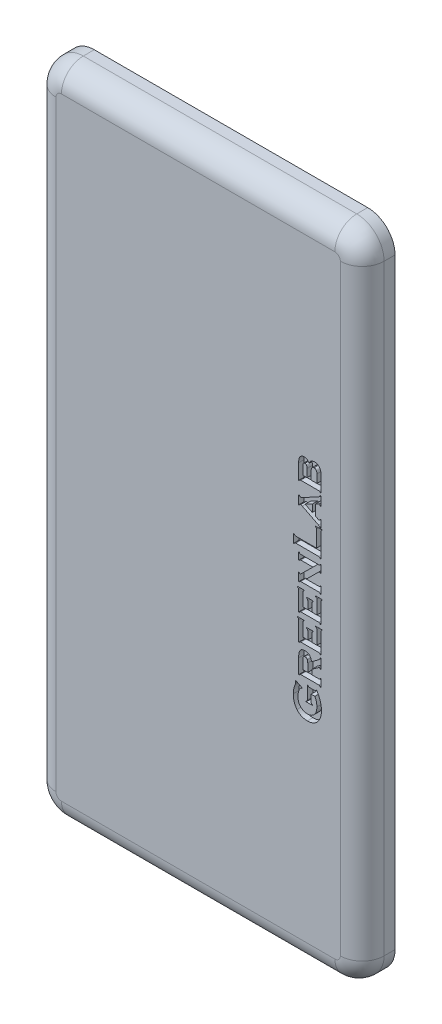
from build123d import *

# Parameters (mm, degrees)
SKETCH1_W           = 29.999998
SKETCH1_H           = 60.000000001
BOSS_EXTRUDE1_DEPTH = 3
FILLET1_R           = 2.5
FILLET2_R           = 2
CUT_EXTRUDE1_DEPTH  = 0.5


with BuildPart() as part:
    # Sketch1 → Boss-Extrude1 (new body)
    with BuildSketch(Plane.XY.offset(3)):
        with Locations((-9.58e-07, 15.00000116)):
            Rectangle(SKETCH1_W, SKETCH1_H)
    extrude(amount=-BOSS_EXTRUDE1_DEPTH)

    # Fillet1
    fillet1_edges = [part.edges().sort_by_distance(p)[0] for p in [
        (-14.999999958, -14.999998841, 1.5),
        (-14.999999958, 45.00000116, 1.5),
        (14.999998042, 45.00000116, 1.5),
        (14.999998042, -14.999998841, 1.5),
    ]]
    fillet(fillet1_edges, radius=FILLET1_R)

    # Fillet2
    fillet2_edges = [part.edges().sort_by_distance(p)[0] for p in [
        (14.999998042, 15.000001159, 3),
        (-9.58e-07, -14.999998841, 3),
        (-9.58e-07, 45.00000116, 3),
        (-14.999999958, 15.000001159, 3),
        (-14.267766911, -14.267765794, 3),
        (-14.267766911, 44.267768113, 3),
        (14.267764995, -14.267765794, 3),
        (14.267764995, 44.267768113, 3),
    ]]
    fillet(fillet2_edges, radius=FILLET2_R)

    # Sketch2 → Cut-Extrude1 (cut)
    # profile 1 of 8: a face of its own
    with BuildSketch(Plane.XY.offset(3)):
        with BuildLine():
            add(Edge.make_bspline(
                [(10.135549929, 25.073785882), (10.146799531, 25.097644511), (10.168002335, 25.14261231), (10.202794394, 25.203529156), (10.237086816, 25.254863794), (10.262562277, 25.283443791), (10.274438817, 25.296767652)],
                knots=[0, 0, 0, 0, 1.199284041, 2.260363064, 3.188989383, 4, 4, 4, 4], degree=3))
            add(Edge.make_bspline(
                [(10.274438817, 25.296767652), (10.285608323, 25.307686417), (10.307958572, 25.329534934), (10.345403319, 25.357738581), (10.386093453, 25.380997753), (10.428917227, 25.400929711), (10.475165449, 25.415333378), (10.523949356, 25.426236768), (10.575727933, 25.432844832), (10.611152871, 25.433628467), (10.629256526, 25.434028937)],
                knots=[0, 0, 0, 0, 0.957204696, 1.915372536, 2.864513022, 3.827290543, 4.805779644, 5.828215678, 6.89012558, 8, 8, 8, 8], degree=3))
            add(Edge.make_bspline(
                [(10.629256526, 25.434028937), (10.653530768, 25.433486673), (10.700864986, 25.432429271), (10.76981119, 25.421764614), (10.834605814, 25.404777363), (10.894850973, 25.379795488), (10.951219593, 25.349148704), (11.002600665, 25.310326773), (11.050400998, 25.265337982), (11.077646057, 25.230423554), (11.091496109, 25.212674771)],
                knots=[0, 0, 0, 0, 1.09149512, 2.128390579, 3.131133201, 4.098244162, 5.056171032, 6.009871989, 6.988316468, 8, 8, 8, 8], degree=3))
            add(Edge.make_bspline(
                [(11.091496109, 25.212674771), (11.103079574, 25.195720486), (11.126628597, 25.161252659), (11.155524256, 25.104416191), (11.180550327, 25.043452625), (11.201282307, 24.977999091), (11.216981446, 24.907741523), (11.227261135, 24.832767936), (11.234867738, 24.753301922), (11.235490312, 24.698733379), (11.235810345, 24.670682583)],
                knots=[0, 0, 0, 0, 0.863603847, 1.755694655, 2.67743618, 3.635676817, 4.642232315, 5.703768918, 6.81962927, 8, 8, 8, 8], degree=3))
            Line((11.235810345, 24.670682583), (11.235810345, 23.246528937))
            Line((11.235810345, 23.246528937), (11.166365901, 23.246528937))
            add(Edge.make_bspline(
                [(11.166365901, 23.246528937), (11.163435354, 23.255433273), (11.157951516, 23.272095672), (11.148016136, 23.2951228), (11.134770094, 23.312951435), (11.120169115, 23.327491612), (11.102620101, 23.337942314), (11.082440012, 23.345531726), (11.058935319, 23.349790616), (11.042323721, 23.350380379), (11.033444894, 23.350695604)],
                knots=[0, 0, 0, 0, 1.214308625, 2.272296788, 3.227641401, 4.072125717, 4.923398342, 5.849609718, 6.850625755, 8, 8, 8, 8], degree=3))
            Line((11.033444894, 23.350695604), (9.389564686, 23.350695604))
            add(Edge.make_bspline(
                [(9.389564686, 23.350695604), (9.380885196, 23.350288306), (9.36452139, 23.34952041), (9.341170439, 23.346368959), (9.321643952, 23.338320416), (9.304262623, 23.328656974), (9.290415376, 23.313814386), (9.277114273, 23.295900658), (9.266068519, 23.272714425), (9.25991858, 23.255627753), (9.256643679, 23.246528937)],
                knots=[0, 0, 0, 0, 1.128659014, 2.127908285, 3.03439063, 3.855433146, 4.685150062, 5.642745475, 6.744739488, 8, 8, 8, 8], degree=3))
            Line((9.256643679, 23.246528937), (9.187199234, 23.246528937))
            Line((9.187199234, 23.246528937), (9.187199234, 24.644098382))
            add(Edge.make_bspline(
                [(9.187199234, 24.644098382), (9.187561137, 24.673773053), (9.188259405, 24.731028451), (9.195123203, 24.813759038), (9.204797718, 24.890569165), (9.220199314, 24.961011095), (9.238843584, 25.025634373), (9.262433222, 25.08377015), (9.288986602, 25.136855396), (9.31172158, 25.167740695), (9.322832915, 25.182835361)],
                knots=[0, 0, 0, 0, 1.259629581, 2.430375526, 3.522812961, 4.543893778, 5.488959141, 6.374407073, 7.205519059, 8, 8, 8, 8], degree=3))
            add(Edge.make_bspline(
                [(9.322832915, 25.182835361), (9.334970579, 25.197438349), (9.358823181, 25.226135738), (9.399979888, 25.263197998), (9.444316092, 25.294408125), (9.491868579, 25.320011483), (9.542734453, 25.340469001), (9.597155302, 25.354099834), (9.654731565, 25.36332657), (9.694249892, 25.364157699), (9.714542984, 25.364584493)],
                knots=[0, 0, 0, 0, 1.01613969, 1.996889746, 2.956405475, 3.914354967, 4.883989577, 5.884961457, 6.913904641, 8, 8, 8, 8], degree=3))
            add(Edge.make_bspline(
                [(9.714542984, 25.364584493), (9.737940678, 25.364028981), (9.782933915, 25.362960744), (9.846818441, 25.350035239), (9.904499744, 25.330303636), (9.956110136, 25.300474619), (10.003184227, 25.259996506), (10.049883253, 25.209804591), (10.09364843, 25.145932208), (10.121049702, 25.098752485), (10.135549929, 25.073785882)],
                knots=[0, 0, 0, 0, 1.030716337, 1.982044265, 2.862735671, 3.709827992, 4.593441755, 5.592771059, 6.726140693, 8, 8, 8, 8], degree=3))
        make_face()
        with BuildLine():
            Line((9.951088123, 23.836806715), (9.951088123, 24.563803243))
            add(Edge.make_bspline(
                [(9.951088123, 24.563803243), (9.950652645, 24.590410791), (9.949847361, 24.639613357), (9.942105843, 24.707132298), (9.929178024, 24.762342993), (9.910272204, 24.80623794), (9.88380491, 24.839792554), (9.848836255, 24.862782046), (9.806318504, 24.876567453), (9.775419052, 24.877812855), (9.759030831, 24.878473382)],
                knots=[0, 0, 0, 0, 1.512131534, 2.796227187, 3.855933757, 4.725485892, 5.492963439, 6.248574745, 7.071092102, 8, 8, 8, 8], degree=3))
            add(Edge.make_bspline(
                [(9.759030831, 24.878473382), (9.742833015, 24.87778248), (9.712533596, 24.876490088), (9.670462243, 24.863206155), (9.63608747, 24.840325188), (9.609267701, 24.807290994), (9.590424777, 24.76346759), (9.578286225, 24.707956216), (9.570328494, 24.640166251), (9.569559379, 24.590595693), (9.569143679, 24.563803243)],
                knots=[0, 0, 0, 0, 0.921305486, 1.723381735, 2.481162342, 3.2428606, 4.114909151, 5.17520465, 6.473222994, 8, 8, 8, 8], degree=3))
            Line((9.569143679, 24.563803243), (9.569143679, 23.836806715))
            Line((9.569143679, 23.836806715), (9.951088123, 23.836806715))
        make_face(mode=Mode.SUBTRACT)
        with BuildLine():
            Line((10.853865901, 23.836806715), (10.853865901, 24.585504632))
            add(Edge.make_bspline(
                [(10.853865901, 24.585504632), (10.853377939, 24.613962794), (10.85246477, 24.667219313), (10.839645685, 24.741380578), (10.820522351, 24.80502799), (10.791398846, 24.857174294), (10.754262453, 24.898833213), (10.707553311, 24.927277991), (10.653193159, 24.945660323), (10.614047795, 24.947139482), (10.593449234, 24.947917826)],
                knots=[0, 0, 0, 0, 1.344028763, 2.515211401, 3.548364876, 4.471249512, 5.318650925, 6.156286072, 7.02982502, 8, 8, 8, 8], degree=3))
            add(Edge.make_bspline(
                [(10.593449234, 24.947917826), (10.573052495, 24.947082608), (10.533955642, 24.945481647), (10.479518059, 24.927599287), (10.433179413, 24.898435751), (10.395306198, 24.857570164), (10.367272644, 24.804701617), (10.346809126, 24.741602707), (10.33539436, 24.667105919), (10.333855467, 24.613936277), (10.333032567, 24.585504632)],
                knots=[0, 0, 0, 0, 0.962178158, 1.844321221, 2.675172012, 3.52884247, 4.448055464, 5.484422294, 6.65483368, 8, 8, 8, 8], degree=3))
            Line((10.333032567, 24.585504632), (10.333032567, 23.836806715))
            Line((10.333032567, 23.836806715), (10.853865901, 23.836806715))
        make_face(mode=Mode.SUBTRACT)
    # profile 2 of 8: a face of its own
    with BuildSketch(Plane.XY.offset(3)):
        with BuildLine():
            Line((10.714977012, 22.139758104), (10.714977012, 21.189779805))
            Line((10.714977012, 21.189779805), (10.933618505, 21.076390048))
            add(Edge.make_bspline(
                [(10.933618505, 21.076390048), (10.946004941, 21.070548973), (10.969009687, 21.059700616), (11.002312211, 21.047998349), (11.031010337, 21.039238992), (11.049130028, 21.038296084), (11.057316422, 21.037870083)],
                knots=[0, 0, 0, 0, 1.258188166, 2.336773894, 3.248561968, 4, 4, 4, 4], degree=3))
            add(Edge.make_bspline(
                [(11.057316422, 21.037870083), (11.06421882, 21.038352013), (11.077523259, 21.039280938), (11.096649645, 21.044620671), (11.11352602, 21.054901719), (11.127916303, 21.069395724), (11.141542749, 21.086872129), (11.151315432, 21.109204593), (11.160134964, 21.134770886), (11.164212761, 21.15337326), (11.166365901, 21.163195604)],
                knots=[0, 0, 0, 0, 0.910861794, 1.755694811, 2.589696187, 3.483236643, 4.43677035, 5.49240796, 6.675952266, 8, 8, 8, 8], degree=3))
            Line((11.166365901, 21.163195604), (11.235810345, 21.163195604))
            Line((11.235810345, 21.163195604), (11.235810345, 20.434028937))
            Line((11.235810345, 20.434028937), (11.166365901, 20.434028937))
            add(Edge.make_bspline(
                [(11.166365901, 20.434028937), (11.164444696, 20.444934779), (11.160775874, 20.465761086), (11.151765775, 20.494266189), (11.140182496, 20.518474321), (11.12538256, 20.539330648), (11.104729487, 20.557800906), (11.078464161, 20.577588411), (11.044028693, 20.597628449), (11.018483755, 20.61117576), (11.004690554, 20.618490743)],
                knots=[0, 0, 0, 0, 1.025916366, 1.959137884, 2.761484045, 3.50604026, 4.312579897, 5.318573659, 6.552141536, 8, 8, 8, 8], degree=3))
            Line((11.004690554, 20.618490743), (9.518687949, 21.372614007))
            add(Edge.make_bspline(
                [(9.518687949, 21.372614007), (9.505217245, 21.378971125), (9.479587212, 21.391066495), (9.441480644, 21.405132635), (9.405615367, 21.412937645), (9.382541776, 21.414292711), (9.37166104, 21.414931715)],
                knots=[0, 0, 0, 0, 1.158371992, 2.203976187, 3.153055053, 4, 4, 4, 4], degree=3))
            add(Edge.make_bspline(
                [(9.37166104, 21.414931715), (9.35981849, 21.413640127), (9.335810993, 21.411021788), (9.302967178, 21.389678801), (9.276382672, 21.355351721), (9.263611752, 21.327206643), (9.256643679, 21.311850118)],
                knots=[0, 0, 0, 0, 0.861054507, 1.745550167, 2.769926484, 4, 4, 4, 4], degree=3))
            Line((9.256643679, 21.311850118), (9.187199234, 21.311850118))
            Line((9.187199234, 21.311850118), (9.187199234, 22.109376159))
            Line((9.187199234, 22.109376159), (9.256643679, 22.109376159))
            add(Edge.make_bspline(
                [(9.256643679, 22.109376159), (9.263263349, 22.094248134), (9.275562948, 22.066139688), (9.304656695, 22.033350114), (9.339648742, 22.012024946), (9.36559023, 22.009660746), (9.378713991, 22.008464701)],
                knots=[0, 0, 0, 0, 1.167592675, 2.169431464, 3.073918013, 4, 4, 4, 4], degree=3))
            add(Edge.make_bspline(
                [(9.378713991, 22.008464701), (9.38925646, 22.009010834), (9.411745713, 22.010175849), (9.446589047, 22.01986944), (9.484871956, 22.033849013), (9.510503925, 22.047035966), (9.524113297, 22.054037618)],
                knots=[0, 0, 0, 0, 0.821709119, 1.75287438, 2.806881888, 4, 4, 4, 4], degree=3))
            Line((9.524113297, 22.054037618), (10.965085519, 22.826607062))
            add(Edge.make_bspline(
                [(10.965085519, 22.826607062), (10.983042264, 22.836635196), (11.015809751, 22.854934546), (11.059511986, 22.881085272), (11.092459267, 22.904547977), (11.117285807, 22.925292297), (11.135038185, 22.947862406), (11.148344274, 22.973716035), (11.159455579, 23.004133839), (11.163964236, 23.026357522), (11.166365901, 23.038195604)],
                knots=[0, 0, 0, 0, 1.612697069, 2.942851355, 3.989484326, 4.783110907, 5.469570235, 6.224377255, 7.054163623, 8, 8, 8, 8], degree=3))
            Line((11.166365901, 23.038195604), (11.235810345, 23.038195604))
            Line((11.235810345, 23.038195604), (11.235810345, 22.187501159))
            Line((11.235810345, 22.187501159), (11.166365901, 22.187501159))
            add(Edge.make_bspline(
                [(11.166365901, 22.187501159), (11.16460006, 22.196779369), (11.161260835, 22.21432457), (11.153106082, 22.238425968), (11.142905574, 22.258904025), (11.130117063, 22.275549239), (11.115312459, 22.289147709), (11.097667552, 22.298222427), (11.078113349, 22.304004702), (11.0644129, 22.304455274), (11.057316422, 22.304688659)],
                knots=[0, 0, 0, 0, 1.280586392, 2.42160363, 3.442514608, 4.370371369, 5.257057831, 6.146457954, 7.039913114, 8, 8, 8, 8], degree=3))
            add(Edge.make_bspline(
                [(11.057316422, 22.304688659), (11.047496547, 22.304131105), (11.026432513, 22.302935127), (10.99350225, 22.293239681), (10.957364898, 22.278678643), (10.93295463, 22.26552447), (10.920055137, 22.258573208)],
                knots=[0, 0, 0, 0, 0.804870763, 1.726480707, 2.798569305, 4, 4, 4, 4], degree=3))
            Line((10.920055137, 22.258573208), (10.714977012, 22.139758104))
        make_face()
        Polygon((10.437199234, 21.994358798), (9.78181729, 21.655817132), (10.437199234, 21.329211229), align=None, mode=Mode.SUBTRACT)
    # profile 3 of 8: a face of its own
    with BuildSketch(Plane.XY.offset(3)):
        with BuildLine():
            Line((10.819143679, 18.697917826), (10.819143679, 20.199111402))
            add(Edge.make_bspline(
                [(10.819143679, 20.199111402), (10.818727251, 20.207787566), (10.817942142, 20.2241451), (10.814926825, 20.247369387), (10.806637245, 20.266623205), (10.797101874, 20.283853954), (10.78240455, 20.297734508), (10.764269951, 20.310437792), (10.74113422, 20.320964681), (10.724073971, 20.326767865), (10.714977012, 20.329862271)],
                knots=[0, 0, 0, 0, 1.136312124, 2.142337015, 3.032986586, 3.859596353, 4.69493934, 5.645323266, 6.744426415, 8, 8, 8, 8], degree=3))
            Line((10.714977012, 20.329862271), (10.714977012, 20.399306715))
            Line((10.714977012, 20.399306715), (11.339977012, 20.399306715))
            Line((11.339977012, 20.399306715), (11.339977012, 20.329862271))
            add(Edge.make_bspline(
                [(11.339977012, 20.329862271), (11.330855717, 20.326812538), (11.313904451, 20.321144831), (11.291066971, 20.310107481), (11.272586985, 20.297929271), (11.257916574, 20.283815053), (11.2481518, 20.266754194), (11.240823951, 20.247004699), (11.236800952, 20.223864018), (11.236150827, 20.20726306), (11.235810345, 20.198568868)],
                knots=[0, 0, 0, 0, 1.252901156, 2.328426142, 3.296223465, 4.129788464, 4.954638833, 5.834908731, 6.866106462, 8, 8, 8, 8], degree=3))
            Line((11.235810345, 20.198568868), (11.235810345, 18.038195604))
            Line((11.235810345, 18.038195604), (11.166365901, 18.038195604))
            add(Edge.make_bspline(
                [(11.166365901, 18.038195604), (11.163275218, 18.047296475), (11.157479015, 18.064364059), (11.146906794, 18.087452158), (11.134269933, 18.105840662), (11.119823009, 18.120139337), (11.102486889, 18.130022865), (11.08291295, 18.138023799), (11.059396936, 18.141218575), (11.042849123, 18.141963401), (11.033987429, 18.142362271)],
                knots=[0, 0, 0, 0, 1.245850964, 2.336443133, 3.279467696, 4.125082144, 4.945291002, 5.850852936, 6.849087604, 8, 8, 8, 8], degree=3))
            Line((11.033987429, 18.142362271), (8.937633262, 18.142362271))
            add(Edge.make_bspline(
                [(8.937633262, 18.142362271), (8.92876918, 18.141971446), (8.912216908, 18.141241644), (8.888561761, 18.137924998), (8.868749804, 18.130126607), (8.851273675, 18.120293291), (8.837379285, 18.105631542), (8.824680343, 18.08748578), (8.814152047, 18.064353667), (8.80834908, 18.04729286), (8.80525479, 18.038195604)],
                knots=[0, 0, 0, 0, 1.150172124, 2.147764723, 3.074619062, 3.894300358, 4.722641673, 5.665059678, 6.754950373, 8, 8, 8, 8], degree=3))
            Line((8.80525479, 18.038195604), (8.735810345, 18.038195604))
            Line((8.735810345, 18.038195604), (8.735810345, 18.802084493))
            Line((8.735810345, 18.802084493), (8.80525479, 18.802084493))
            add(Edge.make_bspline(
                [(8.80525479, 18.802084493), (8.808138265, 18.792974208), (8.813489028, 18.776068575), (8.823879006, 18.753079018), (8.836105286, 18.734506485), (8.850816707, 18.720026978), (8.868512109, 18.710118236), (8.888909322, 18.703133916), (8.912502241, 18.698832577), (8.929295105, 18.698234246), (8.938175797, 18.697917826)],
                knots=[0, 0, 0, 0, 1.231701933, 2.285625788, 3.242999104, 4.084239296, 4.920290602, 5.83495028, 6.855041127, 8, 8, 8, 8], degree=3))
            Line((8.938175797, 18.697917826), (10.819143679, 18.697917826))
        make_face()
    # profile 4 of 8: a face of its own
    with BuildSketch(Plane.XY.offset(3)):
        with BuildLine():
            Line((9.891951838, 15.781251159), (11.03181729, 15.781251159))
            add(Edge.make_bspline(
                [(11.03181729, 15.781251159), (11.040703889, 15.781546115), (11.057330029, 15.782097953), (11.080677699, 15.786595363), (11.101120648, 15.793321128), (11.118693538, 15.804127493), (11.133628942, 15.818598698), (11.146129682, 15.837279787), (11.157659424, 15.85959646), (11.163345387, 15.87645969), (11.166365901, 15.885417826)],
                knots=[0, 0, 0, 0, 1.143670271, 2.139718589, 3.053348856, 3.900396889, 4.773630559, 5.710721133, 6.783882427, 8, 8, 8, 8], degree=3))
            Line((11.166365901, 15.885417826), (11.235810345, 15.885417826))
            Line((11.235810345, 15.885417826), (11.235810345, 15.225695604))
            Line((11.235810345, 15.225695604), (11.166365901, 15.225695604))
            add(Edge.make_bspline(
                [(11.166365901, 15.225695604), (11.163435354, 15.23459994), (11.157951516, 15.251262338), (11.148016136, 15.274289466), (11.134770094, 15.292118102), (11.120169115, 15.306658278), (11.102620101, 15.317108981), (11.082440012, 15.324698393), (11.058935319, 15.328957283), (11.042323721, 15.329547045), (11.033444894, 15.329862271)],
                knots=[0, 0, 0, 0, 1.214308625, 2.272296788, 3.227641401, 4.072125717, 4.923398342, 5.849609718, 6.850625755, 8, 8, 8, 8], degree=3))
            Line((11.033444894, 15.329862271), (9.389564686, 15.329862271))
            add(Edge.make_bspline(
                [(9.389564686, 15.329862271), (9.380885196, 15.329454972), (9.36452139, 15.328687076), (9.341170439, 15.325535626), (9.321643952, 15.317487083), (9.304262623, 15.307823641), (9.290415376, 15.292981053), (9.277114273, 15.275067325), (9.266068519, 15.251881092), (9.25991858, 15.23479442), (9.256643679, 15.225695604)],
                knots=[0, 0, 0, 0, 1.128659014, 2.127908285, 3.03439063, 3.855433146, 4.685150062, 5.642745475, 6.744739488, 8, 8, 8, 8], degree=3))
            Line((9.256643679, 15.225695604), (9.187199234, 15.225695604))
            Line((9.187199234, 15.225695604), (9.187199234, 15.996637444))
            Line((9.187199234, 15.996637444), (9.256643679, 15.996637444))
            add(Edge.make_bspline(
                [(9.256643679, 15.996637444), (9.260100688, 15.984846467), (9.266265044, 15.963821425), (9.281614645, 15.937701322), (9.30214446, 15.920120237), (9.318571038, 15.918313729), (9.326630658, 15.917427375)],
                knots=[0, 0, 0, 0, 1.287745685, 2.296239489, 3.164058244, 4, 4, 4, 4], degree=3))
            add(Edge.make_bspline(
                [(9.326630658, 15.917427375), (9.334145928, 15.918316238), (9.35055889, 15.92025747), (9.375133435, 15.932298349), (9.40135809, 15.950468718), (9.417996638, 15.966345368), (9.426999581, 15.974936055)],
                knots=[0, 0, 0, 0, 0.763994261, 1.668524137, 2.738463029, 4, 4, 4, 4], degree=3))
            Line((9.426999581, 15.974936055), (10.496878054, 17.031251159))
            Line((10.496878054, 17.031251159), (9.389564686, 17.031251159))
            add(Edge.make_bspline(
                [(9.389564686, 17.031251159), (9.380888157, 17.030827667), (9.364351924, 17.030020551), (9.340784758, 17.027029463), (9.320980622, 17.018746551), (9.303253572, 17.009217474), (9.288753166, 16.994705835), (9.276098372, 16.976348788), (9.265531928, 16.953250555), (9.259734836, 16.936184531), (9.256643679, 16.927084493)],
                knots=[0, 0, 0, 0, 1.124712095, 2.143541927, 3.046854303, 3.885165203, 4.728679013, 5.669360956, 6.757243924, 8, 8, 8, 8], degree=3))
            Line((9.256643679, 16.927084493), (9.187199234, 16.927084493))
            Line((9.187199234, 16.927084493), (9.187199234, 17.586806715))
            Line((9.187199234, 17.586806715), (9.256643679, 17.586806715))
            add(Edge.make_bspline(
                [(9.256643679, 17.586806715), (9.259690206, 17.577682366), (9.265351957, 17.560725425), (9.276427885, 17.537924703), (9.288554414, 17.519219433), (9.303292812, 17.504739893), (9.320851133, 17.4949718), (9.340981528, 17.487745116), (9.364263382, 17.483612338), (9.380868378, 17.482974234), (9.389564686, 17.482640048)],
                knots=[0, 0, 0, 0, 1.243685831, 2.311300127, 3.271979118, 4.116123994, 4.955062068, 5.850833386, 6.874446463, 8, 8, 8, 8], degree=3))
            Line((9.389564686, 17.482640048), (11.03181729, 17.482640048))
            add(Edge.make_bspline(
                [(11.03181729, 17.482640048), (11.040515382, 17.482971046), (11.057123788, 17.483603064), (11.080382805, 17.487776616), (11.100438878, 17.494820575), (11.117629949, 17.504914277), (11.132309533, 17.519321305), (11.144891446, 17.538007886), (11.157277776, 17.560519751), (11.163199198, 17.577647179), (11.166365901, 17.586806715)],
                knots=[0, 0, 0, 0, 1.122381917, 2.143110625, 3.036357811, 3.852834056, 4.694600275, 5.665840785, 6.751720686, 8, 8, 8, 8], degree=3))
            Line((11.166365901, 17.586806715), (11.235810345, 17.586806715))
            Line((11.235810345, 17.586806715), (11.235810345, 16.868490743))
            Line((11.235810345, 16.868490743), (11.166365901, 16.868490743))
            add(Edge.make_bspline(
                [(11.166365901, 16.868490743), (11.163398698, 16.880041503), (11.158048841, 16.900867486), (11.14449556, 16.92721614), (11.124427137, 16.944469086), (11.108593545, 16.94626509), (11.100719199, 16.947158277)],
                knots=[0, 0, 0, 0, 1.28387963, 2.314830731, 3.161933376, 4, 4, 4, 4], degree=3))
            add(Edge.make_bspline(
                [(11.100719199, 16.947158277), (11.09201197, 16.945941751), (11.07289378, 16.943270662), (11.050712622, 16.927812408), (11.02990694, 16.909164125), (11.006767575, 16.888299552), (10.977222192, 16.860349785), (10.955810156, 16.83906884), (10.943926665, 16.827258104)],
                knots=[0, 0, 0, 0, 0.778870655, 1.71014178, 2.353616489, 3.294570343, 4.498510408, 6, 6, 6, 6], degree=3))
            Line((10.943926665, 16.827258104), (9.891951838, 15.781251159))
        make_face()
    # profile 5 of 8: a face of its own
    with BuildSketch(Plane.XY.offset(3)):
        with BuildLine():
            Line((10.402477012, 13.420140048), (10.853865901, 13.420140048))
            Line((10.853865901, 13.420140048), (10.853865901, 14.678278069))
            add(Edge.make_bspline(
                [(10.853865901, 14.678278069), (10.853478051, 14.686963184), (10.852754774, 14.703159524), (10.849411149, 14.726263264), (10.84169473, 14.745613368), (10.831451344, 14.762548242), (10.81736952, 14.77694794), (10.798947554, 14.789564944), (10.775870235, 14.800143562), (10.75880099, 14.80593878), (10.749699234, 14.809028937)],
                knots=[0, 0, 0, 0, 1.136968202, 2.120262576, 3.033418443, 3.84032541, 4.69303108, 5.643963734, 6.743701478, 8, 8, 8, 8], degree=3))
            Line((10.749699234, 14.809028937), (10.749699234, 14.878473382))
            Line((10.749699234, 14.878473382), (11.339977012, 14.878473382))
            Line((11.339977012, 14.878473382), (11.339977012, 14.809028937))
            add(Edge.make_bspline(
                [(11.339977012, 14.809028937), (11.331020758, 14.806396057), (11.314138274, 14.801433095), (11.291696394, 14.790487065), (11.273355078, 14.777887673), (11.258704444, 14.763579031), (11.247754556, 14.746385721), (11.241177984, 14.726042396), (11.236685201, 14.702887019), (11.236113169, 14.686441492), (11.235810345, 14.677735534)],
                knots=[0, 0, 0, 0, 1.21379651, 2.287998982, 3.235193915, 4.101035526, 4.937230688, 5.860712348, 6.867500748, 8, 8, 8, 8], degree=3))
            Line((11.235810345, 14.677735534), (11.235810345, 12.829862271))
            Line((11.235810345, 12.829862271), (11.166365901, 12.829862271))
            add(Edge.make_bspline(
                [(11.166365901, 12.829862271), (11.163435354, 12.838766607), (11.157951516, 12.855429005), (11.148016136, 12.878456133), (11.134770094, 12.896284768), (11.120169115, 12.910824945), (11.102620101, 12.921275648), (11.082440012, 12.92886506), (11.058935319, 12.93312395), (11.042323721, 12.933713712), (11.033444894, 12.934028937)],
                knots=[0, 0, 0, 0, 1.214308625, 2.272296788, 3.227641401, 4.072125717, 4.923398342, 5.849609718, 6.850625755, 8, 8, 8, 8], degree=3))
            Line((11.033444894, 12.934028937), (9.389564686, 12.934028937))
            add(Edge.make_bspline(
                [(9.389564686, 12.934028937), (9.380885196, 12.933621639), (9.36452139, 12.932853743), (9.341170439, 12.929702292), (9.321643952, 12.921653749), (9.304262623, 12.911990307), (9.290415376, 12.89714772), (9.277114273, 12.879233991), (9.266068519, 12.856047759), (9.25991858, 12.838961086), (9.256643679, 12.829862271)],
                knots=[0, 0, 0, 0, 1.128659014, 2.127908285, 3.03439063, 3.855433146, 4.685150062, 5.642745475, 6.744739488, 8, 8, 8, 8], degree=3))
            Line((9.256643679, 12.829862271), (9.187199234, 12.829862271))
            Line((9.187199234, 12.829862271), (9.187199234, 14.607748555))
            add(Edge.make_bspline(
                [(9.187199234, 14.607748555), (9.186800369, 14.616610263), (9.186055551, 14.633158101), (9.18286072, 14.656673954), (9.174859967, 14.676248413), (9.164975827, 14.693582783), (9.150679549, 14.708036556), (9.13228048, 14.720643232), (9.109295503, 14.731329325), (9.092148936, 14.736718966), (9.083032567, 14.739584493)],
                knots=[0, 0, 0, 0, 1.152027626, 2.151229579, 3.057668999, 3.878672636, 4.725106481, 5.669044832, 6.76069378, 8, 8, 8, 8], degree=3))
            Line((9.083032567, 14.739584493), (9.083032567, 14.809028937))
            Line((9.083032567, 14.809028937), (9.673310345, 14.809028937))
            Line((9.673310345, 14.809028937), (9.673310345, 14.739584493))
            add(Edge.make_bspline(
                [(9.673310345, 14.739584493), (9.664185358, 14.736731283), (9.647022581, 14.73136481), (9.624008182, 14.720463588), (9.605168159, 14.708220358), (9.590864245, 14.693554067), (9.580950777, 14.676497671), (9.573475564, 14.656775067), (9.570332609, 14.633522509), (9.569552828, 14.616974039), (9.569143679, 14.60829109)],
                knots=[0, 0, 0, 0, 1.241043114, 2.334222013, 3.298856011, 4.146476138, 4.968630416, 5.84602308, 6.869812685, 8, 8, 8, 8], degree=3))
            Line((9.569143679, 14.60829109), (9.569143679, 13.420140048))
            Line((9.569143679, 13.420140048), (10.020532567, 13.420140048))
            Line((10.020532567, 13.420140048), (10.020532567, 14.157444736))
            add(Edge.make_bspline(
                [(10.020532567, 14.157444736), (10.02012797, 14.165945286), (10.019366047, 14.181953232), (10.016189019, 14.204752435), (10.008223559, 14.22382168), (9.998128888, 14.240629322), (9.984044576, 14.255052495), (9.965492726, 14.267581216), (9.942597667, 14.278829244), (9.925480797, 14.284941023), (9.916365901, 14.288195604)],
                knots=[0, 0, 0, 0, 1.117146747, 2.103772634, 2.997955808, 3.807596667, 4.6631914, 5.617345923, 6.731213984, 8, 8, 8, 8], degree=3))
            Line((9.916365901, 14.288195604), (9.916365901, 14.357640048))
            Line((9.916365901, 14.357640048), (10.506643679, 14.357640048))
            Line((10.506643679, 14.357640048), (10.506643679, 14.288195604))
            add(Edge.make_bspline(
                [(10.506643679, 14.288195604), (10.497694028, 14.285349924), (10.480872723, 14.280001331), (10.458297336, 14.268956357), (10.439748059, 14.256838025), (10.425205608, 14.242531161), (10.414704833, 14.225810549), (10.407538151, 14.20585104), (10.403453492, 14.182748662), (10.402812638, 14.166141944), (10.402477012, 14.157444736)],
                knots=[0, 0, 0, 0, 1.225527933, 2.303439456, 3.273384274, 4.108798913, 4.947881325, 5.830104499, 6.863590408, 8, 8, 8, 8], degree=3))
            Line((10.402477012, 14.157444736), (10.402477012, 13.420140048))
        make_face()
    # profile 6 of 8: a face of its own
    with BuildSketch(Plane.XY.offset(3)):
        with BuildLine():
            Line((10.402477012, 11.024306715), (10.853865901, 11.024306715))
            Line((10.853865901, 11.024306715), (10.853865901, 12.282444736))
            add(Edge.make_bspline(
                [(10.853865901, 12.282444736), (10.853478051, 12.29112985), (10.852754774, 12.30732619), (10.849411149, 12.33042993), (10.84169473, 12.349780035), (10.831451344, 12.366714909), (10.81736952, 12.381114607), (10.798947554, 12.393731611), (10.775870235, 12.404310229), (10.75880099, 12.410105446), (10.749699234, 12.413195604)],
                knots=[0, 0, 0, 0, 1.136968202, 2.120262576, 3.033418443, 3.84032541, 4.69303108, 5.643963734, 6.743701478, 8, 8, 8, 8], degree=3))
            Line((10.749699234, 12.413195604), (10.749699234, 12.482640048))
            Line((10.749699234, 12.482640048), (11.339977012, 12.482640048))
            Line((11.339977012, 12.482640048), (11.339977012, 12.413195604))
            add(Edge.make_bspline(
                [(11.339977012, 12.413195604), (11.331020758, 12.410562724), (11.314138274, 12.405599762), (11.291696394, 12.394653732), (11.273355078, 12.38205434), (11.258704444, 12.367745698), (11.247754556, 12.350552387), (11.241177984, 12.330209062), (11.236685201, 12.307053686), (11.236113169, 12.290608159), (11.235810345, 12.281902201)],
                knots=[0, 0, 0, 0, 1.21379651, 2.287998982, 3.235193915, 4.101035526, 4.937230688, 5.860712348, 6.867500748, 8, 8, 8, 8], degree=3))
            Line((11.235810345, 12.281902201), (11.235810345, 10.434028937))
            Line((11.235810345, 10.434028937), (11.166365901, 10.434028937))
            add(Edge.make_bspline(
                [(11.166365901, 10.434028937), (11.163435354, 10.442933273), (11.157951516, 10.459595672), (11.148016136, 10.4826228), (11.134770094, 10.500451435), (11.120169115, 10.514991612), (11.102620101, 10.525442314), (11.082440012, 10.533031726), (11.058935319, 10.537290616), (11.042323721, 10.537880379), (11.033444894, 10.538195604)],
                knots=[0, 0, 0, 0, 1.214308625, 2.272296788, 3.227641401, 4.072125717, 4.923398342, 5.849609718, 6.850625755, 8, 8, 8, 8], degree=3))
            Line((11.033444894, 10.538195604), (9.389564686, 10.538195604))
            add(Edge.make_bspline(
                [(9.389564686, 10.538195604), (9.380885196, 10.537788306), (9.36452139, 10.53702041), (9.341170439, 10.533868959), (9.321643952, 10.525820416), (9.304262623, 10.516156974), (9.290415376, 10.501314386), (9.277114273, 10.483400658), (9.266068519, 10.460214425), (9.25991858, 10.443127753), (9.256643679, 10.434028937)],
                knots=[0, 0, 0, 0, 1.128659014, 2.127908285, 3.03439063, 3.855433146, 4.685150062, 5.642745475, 6.744739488, 8, 8, 8, 8], degree=3))
            Line((9.256643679, 10.434028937), (9.187199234, 10.434028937))
            Line((9.187199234, 10.434028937), (9.187199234, 12.211915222))
            add(Edge.make_bspline(
                [(9.187199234, 12.211915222), (9.186800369, 12.220776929), (9.186055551, 12.237324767), (9.18286072, 12.260840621), (9.174859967, 12.28041508), (9.164975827, 12.297749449), (9.150679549, 12.312203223), (9.13228048, 12.324809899), (9.109295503, 12.335495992), (9.092148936, 12.340885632), (9.083032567, 12.343751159)],
                knots=[0, 0, 0, 0, 1.152027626, 2.151229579, 3.057668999, 3.878672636, 4.725106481, 5.669044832, 6.76069378, 8, 8, 8, 8], degree=3))
            Line((9.083032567, 12.343751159), (9.083032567, 12.413195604))
            Line((9.083032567, 12.413195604), (9.673310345, 12.413195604))
            Line((9.673310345, 12.413195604), (9.673310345, 12.343751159))
            add(Edge.make_bspline(
                [(9.673310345, 12.343751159), (9.664185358, 12.34089795), (9.647022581, 12.335531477), (9.624008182, 12.324630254), (9.605168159, 12.312387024), (9.590864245, 12.297720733), (9.580950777, 12.280664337), (9.573475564, 12.260941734), (9.570332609, 12.237689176), (9.569552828, 12.221140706), (9.569143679, 12.212457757)],
                knots=[0, 0, 0, 0, 1.241043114, 2.334222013, 3.298856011, 4.146476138, 4.968630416, 5.84602308, 6.869812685, 8, 8, 8, 8], degree=3))
            Line((9.569143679, 12.212457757), (9.569143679, 11.024306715))
            Line((9.569143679, 11.024306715), (10.020532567, 11.024306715))
            Line((10.020532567, 11.024306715), (10.020532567, 11.761611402))
            add(Edge.make_bspline(
                [(10.020532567, 11.761611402), (10.02012797, 11.770111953), (10.019366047, 11.786119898), (10.016189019, 11.808919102), (10.008223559, 11.827988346), (9.998128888, 11.844795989), (9.984044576, 11.859219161), (9.965492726, 11.871747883), (9.942597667, 11.882995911), (9.925480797, 11.88910769), (9.916365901, 11.892362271)],
                knots=[0, 0, 0, 0, 1.117146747, 2.103772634, 2.997955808, 3.807596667, 4.6631914, 5.617345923, 6.731213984, 8, 8, 8, 8], degree=3))
            Line((9.916365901, 11.892362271), (9.916365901, 11.961806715))
            Line((9.916365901, 11.961806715), (10.506643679, 11.961806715))
            Line((10.506643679, 11.961806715), (10.506643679, 11.892362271))
            add(Edge.make_bspline(
                [(10.506643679, 11.892362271), (10.497694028, 11.889516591), (10.480872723, 11.884167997), (10.458297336, 11.873123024), (10.439748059, 11.861004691), (10.425205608, 11.846697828), (10.414704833, 11.829977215), (10.407538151, 11.810017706), (10.403453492, 11.786915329), (10.402812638, 11.770308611), (10.402477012, 11.761611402)],
                knots=[0, 0, 0, 0, 1.225527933, 2.303439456, 3.273384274, 4.108798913, 4.947881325, 5.830104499, 6.863590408, 8, 8, 8, 8], degree=3))
            Line((10.402477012, 11.761611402), (10.402477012, 11.024306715))
        make_face()
    # profile 7 of 8: a face of its own
    with BuildSketch(Plane.XY.offset(3)):
        with BuildLine():
            Line((10.402477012, 8.454862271), (11.033987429, 8.454862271))
            add(Edge.make_bspline(
                [(11.033987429, 8.454862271), (11.042693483, 8.455156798), (11.058961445, 8.455707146), (11.081777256, 8.460196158), (11.101441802, 8.466875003), (11.118241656, 8.477325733), (11.132837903, 8.491532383), (11.145518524, 8.510097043), (11.157137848, 8.53290772), (11.163140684, 8.549899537), (11.166365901, 8.559028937)],
                knots=[0, 0, 0, 0, 1.133233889, 2.117538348, 3.019422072, 3.823678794, 4.673583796, 5.654214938, 6.739651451, 8, 8, 8, 8], degree=3))
            Line((11.166365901, 8.559028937), (11.235810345, 8.559028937))
            Line((11.235810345, 8.559028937), (11.235810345, 7.864584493))
            Line((11.235810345, 7.864584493), (11.166365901, 7.864584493))
            add(Edge.make_bspline(
                [(11.166365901, 7.864584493), (11.163435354, 7.873488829), (11.157951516, 7.890151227), (11.148016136, 7.913178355), (11.134770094, 7.931006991), (11.120169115, 7.945547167), (11.102620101, 7.95599787), (11.082440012, 7.963587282), (11.058935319, 7.967846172), (11.042323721, 7.968435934), (11.033444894, 7.968751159)],
                knots=[0, 0, 0, 0, 1.214308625, 2.272296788, 3.227641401, 4.072125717, 4.923398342, 5.849609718, 6.850625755, 8, 8, 8, 8], degree=3))
            Line((11.033444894, 7.968751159), (9.389564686, 7.968751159))
            add(Edge.make_bspline(
                [(9.389564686, 7.968751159), (9.380885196, 7.968343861), (9.36452139, 7.967575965), (9.341170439, 7.964424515), (9.321643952, 7.956375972), (9.304262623, 7.94671253), (9.290415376, 7.931869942), (9.277114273, 7.913956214), (9.266068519, 7.890769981), (9.25991858, 7.873683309), (9.256643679, 7.864584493)],
                knots=[0, 0, 0, 0, 1.128659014, 2.127908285, 3.03439063, 3.855433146, 4.685150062, 5.642745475, 6.744739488, 8, 8, 8, 8], degree=3))
            Line((9.256643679, 7.864584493), (9.187199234, 7.864584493))
            Line((9.187199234, 7.864584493), (9.187199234, 9.194879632))
            add(Edge.make_bspline(
                [(9.187199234, 9.194879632), (9.187464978, 9.23557549), (9.187962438, 9.311756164), (9.192734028, 9.418356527), (9.200429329, 9.50947573), (9.211727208, 9.587323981), (9.227684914, 9.655905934), (9.249560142, 9.718598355), (9.275995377, 9.778084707), (9.298201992, 9.814667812), (9.309269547, 9.832900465)],
                knots=[0, 0, 0, 0, 1.481606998, 2.773496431, 3.884065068, 4.809673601, 5.635344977, 6.4432619, 7.224137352, 8, 8, 8, 8], degree=3))
            add(Edge.make_bspline(
                [(9.309269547, 9.832900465), (9.321807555, 9.850475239), (9.3465432, 9.885147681), (9.391769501, 9.929916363), (9.442348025, 9.967844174), (9.498699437, 9.999053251), (9.561109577, 10.022676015), (9.628759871, 10.040066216), (9.702101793, 10.050506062), (9.752846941, 10.051546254), (9.779104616, 10.052084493)],
                knots=[0, 0, 0, 0, 0.954938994, 1.883953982, 2.805234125, 3.748304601, 4.727237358, 5.753162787, 6.837391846, 8, 8, 8, 8], degree=3))
            add(Edge.make_bspline(
                [(9.779104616, 10.052084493), (9.799195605, 10.051685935), (9.838402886, 10.050908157), (9.895591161, 10.044327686), (9.949250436, 10.033432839), (9.999831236, 10.01909364), (10.046467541, 9.999165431), (10.090487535, 9.976017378), (10.130475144, 9.947610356), (10.167515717, 9.915167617), (10.201155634, 9.877766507), (10.233097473, 9.835797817), (10.261303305, 9.787982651), (10.287739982, 9.735287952), (10.311201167, 9.677277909), (10.333100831, 9.614178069), (10.351948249, 9.545601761), (10.362373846, 9.497847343), (10.36775479, 9.473199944)],
                knots=[0, 0, 0, 0, 1.054974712, 2.05876829, 3.018077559, 3.928757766, 4.81427522, 5.67693176, 6.535972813, 7.383915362, 8.257948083, 9.17356801, 10.149288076, 11.168732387, 12.267602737, 13.433048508, 14.67512408, 16, 16, 16, 16], degree=3))
            Line((10.36775479, 9.473199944), (10.903236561, 9.870335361))
            add(Edge.make_bspline(
                [(10.903236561, 9.870335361), (10.925650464, 9.887302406), (10.967102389, 9.918680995), (11.021865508, 9.96497414), (11.065999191, 10.004859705), (11.099558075, 10.041155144), (11.124703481, 10.076360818), (11.143796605, 10.112484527), (11.15828295, 10.150754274), (11.163656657, 10.17749274), (11.166365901, 10.190973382)],
                knots=[0, 0, 0, 0, 1.582811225, 2.927226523, 4.03709032, 4.931114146, 5.705394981, 6.46623019, 7.226724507, 8, 8, 8, 8], degree=3))
            Line((11.166365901, 10.190973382), (11.235810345, 10.190973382))
            Line((11.235810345, 10.190973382), (11.235810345, 9.26595168))
            Line((11.235810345, 9.26595168), (11.166365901, 9.26595168))
            add(Edge.make_bspline(
                [(11.166365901, 9.26595168), (11.162279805, 9.28068357), (11.154994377, 9.306950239), (11.13717205, 9.339111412), (11.114691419, 9.361717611), (11.096035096, 9.364101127), (11.087155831, 9.365235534)],
                knots=[0, 0, 0, 0, 1.338390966, 2.386324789, 3.231989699, 4, 4, 4, 4], degree=3))
            add(Edge.make_bspline(
                [(11.087155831, 9.365235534), (11.079629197, 9.364358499), (11.062382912, 9.362348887), (11.035533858, 9.348241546), (11.002998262, 9.329289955), (10.980967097, 9.311861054), (10.968883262, 9.302301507)],
                knots=[0, 0, 0, 0, 0.664756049, 1.523200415, 2.641504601, 4, 4, 4, 4], degree=3))
            Line((10.968883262, 9.302301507), (10.402477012, 8.893772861))
            Line((10.402477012, 8.893772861), (10.402477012, 8.454862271))
        make_face()
        with BuildLine():
            Line((10.020532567, 8.454862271), (10.020532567, 9.200304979))
            add(Edge.make_bspline(
                [(10.020532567, 9.200304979), (10.020179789, 9.226728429), (10.019521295, 9.276050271), (10.013192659, 9.344628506), (10.002890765, 9.40265397), (9.990396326, 9.436249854), (9.984725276, 9.451498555)],
                knots=[0, 0, 0, 0, 1.241709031, 2.317766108, 3.236457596, 4, 4, 4, 4], degree=3))
            add(Edge.make_bspline(
                [(9.984725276, 9.451498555), (9.980462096, 9.460507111), (9.972135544, 9.478102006), (9.955510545, 9.501555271), (9.936690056, 9.522188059), (9.913659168, 9.538030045), (9.88800246, 9.550466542), (9.859569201, 9.559764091), (9.828145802, 9.565271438), (9.806254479, 9.565732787), (9.794838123, 9.565973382)],
                knots=[0, 0, 0, 0, 1.008030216, 1.968815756, 2.902121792, 3.822384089, 4.781245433, 5.783764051, 6.844229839, 8, 8, 8, 8], degree=3))
            add(Edge.make_bspline(
                [(9.794838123, 9.565973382), (9.775190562, 9.565245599), (9.738455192, 9.563884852), (9.687964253, 9.548534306), (9.646885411, 9.522823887), (9.620945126, 9.492413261), (9.606567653, 9.462766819), (9.595728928, 9.437095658), (9.58825259, 9.407001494), (9.580929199, 9.373236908), (9.575751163, 9.335501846), (9.572150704, 9.293851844), (9.569109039, 9.248452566), (9.569131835, 9.216767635), (9.569143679, 9.200304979)],
                knots=[0, 0, 0, 0, 1.425165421, 2.66465546, 3.788225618, 4.907941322, 5.513716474, 6.180377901, 6.930065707, 7.763120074, 8.692993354, 9.696653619, 10.803241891, 12, 12, 12, 12], degree=3))
            Line((9.569143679, 9.200304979), (9.569143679, 8.454862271))
            Line((9.569143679, 8.454862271), (10.020532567, 8.454862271))
        make_face(mode=Mode.SUBTRACT)
    # profile 8 of 8: a face of its own
    with BuildSketch(Plane.XY.offset(3)):
        with BuildLine():
            Line((10.333032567, 6.892362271), (10.333032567, 6.263021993))
            add(Edge.make_bspline(
                [(10.333032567, 6.263021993), (10.333352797, 6.253961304), (10.333958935, 6.236811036), (10.338193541, 6.21284704), (10.345110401, 6.192386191), (10.355166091, 6.175079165), (10.369786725, 6.160916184), (10.388428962, 6.148866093), (10.410962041, 6.137042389), (10.428047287, 6.131462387), (10.437199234, 6.128473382)],
                knots=[0, 0, 0, 0, 1.162769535, 2.20091524, 3.111292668, 3.923438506, 4.744164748, 5.697055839, 6.76639631, 8, 8, 8, 8], degree=3))
            Line((10.437199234, 6.128473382), (10.437199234, 6.059028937))
            Line((10.437199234, 6.059028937), (9.881643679, 6.059028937))
            Line((9.881643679, 6.059028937), (9.881643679, 6.128473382))
            add(Edge.make_bspline(
                [(9.881643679, 6.128473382), (9.890984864, 6.131450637), (9.908436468, 6.137012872), (9.931150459, 6.148881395), (9.95032127, 6.160133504), (9.964009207, 6.174691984), (9.974301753, 6.191221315), (9.981332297, 6.211167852), (9.984686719, 6.234698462), (9.985421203, 6.251439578), (9.985810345, 6.260309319)],
                knots=[0, 0, 0, 0, 1.267855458, 2.368662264, 3.318017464, 4.130433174, 4.930580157, 5.827855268, 6.849158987, 8, 8, 8, 8], degree=3))
            Line((9.985810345, 6.260309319), (9.985810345, 7.447917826))
            Line((9.985810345, 7.447917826), (10.05525479, 7.447917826))
            add(Edge.make_bspline(
                [(10.05525479, 7.447917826), (10.05806978, 7.438948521), (10.063360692, 7.422090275), (10.074696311, 7.39993351), (10.085432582, 7.380886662), (10.099248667, 7.366734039), (10.115082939, 7.355657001), (10.13426974, 7.349206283), (10.156125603, 7.344558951), (10.171687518, 7.344033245), (10.180037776, 7.343751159)],
                knots=[0, 0, 0, 0, 1.260451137, 2.369079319, 3.340265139, 4.182477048, 5.004819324, 5.912182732, 6.879712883, 8, 8, 8, 8], degree=3))
            Line((10.180037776, 7.343751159), (10.65963847, 7.343751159))
            add(Edge.make_bspline(
                [(10.65963847, 7.343751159), (10.667967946, 7.344120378), (10.683457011, 7.344806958), (10.705366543, 7.348346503), (10.723967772, 7.355413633), (10.74009068, 7.365531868), (10.753600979, 7.380010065), (10.765247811, 7.39875454), (10.776231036, 7.421615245), (10.781578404, 7.438787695), (10.784421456, 7.447917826)],
                knots=[0, 0, 0, 0, 1.117892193, 2.078774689, 2.961505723, 3.768722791, 4.60913424, 5.591204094, 6.719307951, 8, 8, 8, 8], degree=3))
            Line((10.784421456, 7.447917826), (10.853865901, 7.447917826))
            add(Edge.make_bspline(
                [(10.853865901, 7.447917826), (10.887116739, 7.389334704), (10.952476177, 7.274180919), (11.036958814, 7.097912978), (11.108893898, 6.923167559), (11.167743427, 6.749783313), (11.213733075, 6.577821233), (11.246218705, 6.407209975), (11.266722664, 6.23784368), (11.26926784, 6.125274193), (11.270532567, 6.069337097)],
                knots=[0, 0, 0, 0, 1.109239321, 2.180373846, 3.216973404, 4.220153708, 5.194106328, 6.146335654, 7.078892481, 8, 8, 8, 8], degree=3))
            add(Edge.make_bspline(
                [(11.270532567, 6.069337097), (11.269796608, 6.019931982), (11.268359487, 5.923457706), (11.254299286, 5.782270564), (11.23235152, 5.648076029), (11.201616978, 5.520600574), (11.161362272, 5.400045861), (11.111975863, 5.286603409), (11.053993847, 5.179741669), (11.00803731, 5.114072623), (10.985159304, 5.081381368)],
                knots=[0, 0, 0, 0, 1.132985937, 2.212402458, 3.251065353, 4.250163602, 5.21697858, 6.162602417, 7.085309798, 8, 8, 8, 8], degree=3))
            add(Edge.make_bspline(
                [(10.985159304, 5.081381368), (10.969978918, 5.061876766), (10.939844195, 5.023158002), (10.891738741, 4.968373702), (10.840836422, 4.917839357), (10.788529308, 4.870450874), (10.733211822, 4.82740777), (10.675905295, 4.788027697), (10.616750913, 4.751829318), (10.554990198, 4.720576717), (10.491434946, 4.692022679), (10.425369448, 4.667822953), (10.357199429, 4.647271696), (10.287081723, 4.629527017), (10.214503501, 4.616816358), (10.139701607, 4.607740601), (10.062961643, 4.601321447), (10.010961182, 4.600905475), (9.984725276, 4.600695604)],
                knots=[0, 0, 0, 0, 1.027594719, 2.039887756, 3.02889878, 4.008719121, 4.97294883, 5.940778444, 6.898978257, 7.854104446, 8.816896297, 9.794723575, 10.777166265, 11.776613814, 12.800294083, 13.838400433, 14.909403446, 16, 16, 16, 16], degree=3))
            add(Edge.make_bspline(
                [(9.984725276, 4.600695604), (9.936186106, 4.601837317), (9.841383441, 4.604067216), (9.702956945, 4.624689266), (9.572197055, 4.658278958), (9.448668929, 4.704810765), (9.333339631, 4.765876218), (9.225280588, 4.839326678), (9.124867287, 4.926805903), (9.06583546, 4.994040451), (9.035832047, 5.028212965)],
                knots=[0, 0, 0, 0, 1.080618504, 2.110574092, 3.109061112, 4.08310081, 5.043468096, 6.008781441, 6.987946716, 8, 8, 8, 8], degree=3))
            add(Edge.make_bspline(
                [(9.035832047, 5.028212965), (9.008799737, 5.062732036), (8.954491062, 5.132081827), (8.887240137, 5.247215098), (8.829294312, 5.369865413), (8.782123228, 5.501042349), (8.745961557, 5.640573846), (8.720121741, 5.788249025), (8.704142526, 5.944203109), (8.702121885, 6.051032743), (8.701088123, 6.105686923)],
                knots=[0, 0, 0, 0, 0.913103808, 1.834451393, 2.772129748, 3.738097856, 4.735733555, 5.773315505, 6.860825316, 8, 8, 8, 8], degree=3))
            add(Edge.make_bspline(
                [(8.701088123, 6.105686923), (8.701697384, 6.140780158), (8.702898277, 6.209951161), (8.709761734, 6.312134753), (8.722412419, 6.411162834), (8.739975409, 6.508995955), (8.763911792, 6.608497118), (8.794000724, 6.713104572), (8.830842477, 6.824019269), (8.859412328, 6.899515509), (8.874156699, 6.938477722)],
                knots=[0, 0, 0, 0, 0.983904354, 1.939338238, 2.869415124, 3.781350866, 4.72455948, 5.737149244, 6.832184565, 8, 8, 8, 8], degree=3))
            add(Edge.make_bspline(
                [(8.874156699, 6.938477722), (8.881587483, 6.957579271), (8.895219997, 6.992622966), (8.911062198, 7.041238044), (8.921322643, 7.081118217), (8.923239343, 7.104996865), (8.924069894, 7.115344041)],
                knots=[0, 0, 0, 0, 1.33242011, 2.444457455, 3.325947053, 4, 4, 4, 4], degree=3))
            add(Edge.make_bspline(
                [(8.924069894, 7.115344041), (8.923430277, 7.122084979), (8.922064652, 7.136477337), (8.914024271, 7.158598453), (8.899696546, 7.181410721), (8.888038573, 7.196646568), (8.881752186, 7.204862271)],
                knots=[0, 0, 0, 0, 0.803820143, 1.716210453, 2.768500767, 4, 4, 4, 4], degree=3))
            Line((8.881752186, 7.204862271), (8.909421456, 7.274306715))
            Line((8.909421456, 7.274306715), (9.50837979, 6.979167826))
            Line((9.50837979, 6.979167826), (9.480167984, 6.925999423))
            add(Edge.make_bspline(
                [(9.480167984, 6.925999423), (9.470560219, 6.925697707), (9.452888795, 6.925142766), (9.428649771, 6.920974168), (9.408517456, 6.916517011), (9.391311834, 6.909833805), (9.376343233, 6.898650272), (9.359957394, 6.884751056), (9.342881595, 6.865337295), (9.331264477, 6.850817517), (9.325003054, 6.842991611)],
                knots=[0, 0, 0, 0, 1.244331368, 2.288680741, 3.181265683, 3.916936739, 4.658188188, 5.588746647, 6.700376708, 8, 8, 8, 8], degree=3))
            add(Edge.make_bspline(
                [(9.325003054, 6.842991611), (9.310746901, 6.822321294), (9.280491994, 6.778454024), (9.2430917, 6.701491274), (9.208202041, 6.612173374), (9.177269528, 6.512356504), (9.151084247, 6.407884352), (9.132059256, 6.303510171), (9.120068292, 6.201996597), (9.118516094, 6.135195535), (9.11775479, 6.102431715)],
                knots=[0, 0, 0, 0, 0.772496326, 1.63941874, 2.627276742, 3.724866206, 4.855665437, 5.9428017, 6.991008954, 8, 8, 8, 8], degree=3))
            add(Edge.make_bspline(
                [(9.11775479, 6.102431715), (9.118303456, 6.07021177), (9.119376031, 6.007225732), (9.130044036, 5.914689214), (9.147217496, 5.826501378), (9.171148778, 5.742202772), (9.201973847, 5.662426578), (9.240000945, 5.586856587), (9.283891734, 5.514860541), (9.319255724, 5.471101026), (9.336938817, 5.449219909)],
                knots=[0, 0, 0, 0, 1.098368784, 2.14717621, 3.171603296, 4.15934231, 5.131674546, 6.083189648, 7.041535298, 8, 8, 8, 8], degree=3))
            add(Edge.make_bspline(
                [(9.336938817, 5.449219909), (9.357921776, 5.425715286), (9.399174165, 5.379505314), (9.469755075, 5.320081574), (9.544652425, 5.26944062), (9.624643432, 5.227679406), (9.709749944, 5.195599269), (9.799888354, 5.173125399), (9.894717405, 5.158300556), (9.959711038, 5.156943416), (9.992863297, 5.156251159)],
                knots=[0, 0, 0, 0, 1.016795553, 1.999014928, 2.971244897, 3.932867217, 4.907271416, 5.901990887, 6.92983762, 8, 8, 8, 8], degree=3))
            add(Edge.make_bspline(
                [(9.992863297, 5.156251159), (10.025107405, 5.156990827), (10.088267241, 5.158439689), (10.180405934, 5.172565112), (10.267888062, 5.194456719), (10.350370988, 5.226393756), (10.428364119, 5.266586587), (10.501566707, 5.315855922), (10.57011168, 5.374086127), (10.610415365, 5.419236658), (10.63088413, 5.442166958)],
                knots=[0, 0, 0, 0, 1.069572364, 2.095080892, 3.086556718, 4.05754135, 5.024062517, 5.993022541, 6.980729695, 8, 8, 8, 8], degree=3))
            add(Edge.make_bspline(
                [(10.63088413, 5.442166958), (10.648704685, 5.464435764), (10.684502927, 5.509169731), (10.730115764, 5.582804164), (10.767908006, 5.662000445), (10.799570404, 5.745784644), (10.824056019, 5.834782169), (10.840997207, 5.929035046), (10.852406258, 6.028367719), (10.8533725, 6.096430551), (10.853865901, 6.131186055)],
                knots=[0, 0, 0, 0, 0.924808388, 1.857771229, 2.80254234, 3.768129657, 4.760342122, 5.792672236, 6.872853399, 8, 8, 8, 8], degree=3))
            add(Edge.make_bspline(
                [(10.853865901, 6.131186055), (10.853449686, 6.165751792), (10.852617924, 6.234827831), (10.842600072, 6.338005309), (10.828541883, 6.440666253), (10.807038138, 6.541407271), (10.781606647, 6.638611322), (10.751362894, 6.730097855), (10.716317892, 6.814452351), (10.688771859, 6.86686562), (10.675371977, 6.892362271)],
                knots=[0, 0, 0, 0, 1.050243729, 2.098803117, 3.148241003, 4.198254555, 5.227561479, 6.200971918, 7.124855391, 8, 8, 8, 8], degree=3))
            Line((10.675371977, 6.892362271), (10.333032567, 6.892362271))
        make_face()
    extrude(amount=-CUT_EXTRUDE1_DEPTH, mode=Mode.SUBTRACT)


solid = part.part
